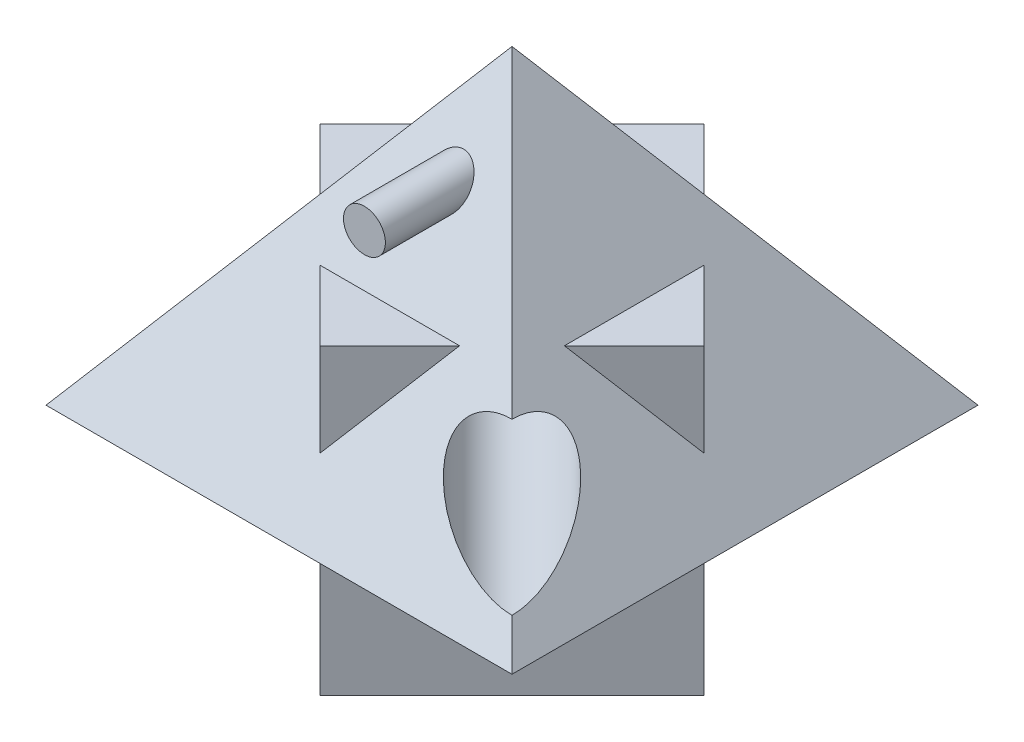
from build123d import *

# Parameters (mm, degrees)
BOSS_EXTRUDE1_DEPTH     = 99.06
CUT_EXTRUDE1_DEPTH      = 184.006502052
CUT_EXTRUDE1_DEPTH_BACK = 184.006502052
SKETCH4_R               = 15.875
SKETCH5_R               = 6.852684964
BOSS_EXTRUDE2_DEPTH     = 48.26


with BuildPart() as part:
    # Sketch1 → Loft1 section 0
    with BuildSketch(Plane(origin=(0, 0, 0), x_dir=(1, 0, 0), z_dir=(0, 1, 0)), mode=Mode.PRIVATE) as loft1_s0:
        with BuildLine():
            Line((-76.2, -76.2), (76.2, -76.2))
            Line((76.2, -76.2), (76.2, 76.2))
            Line((76.2, 76.2), (-76.2, 76.2))
            Line((-76.2, 76.2), (-76.2, -76.2))
        make_face()
    loft([loft1_s0.sketch, Vertex(0, 101.6, 0)])

    # Sketch3 → Boss-Extrude1 (add)
    with BuildSketch(Plane.XZ.offset(50.8)):
        Polygon((0, -62.861792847), (62.861792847, 0), (0, 62.861792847), (-62.861792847, 0), align=None)
    extrude(amount=-BOSS_EXTRUDE1_DEPTH)

    # Sketch4 → Cut-Extrude1 (cut, two sides: drawn at the far end of the back side and taken through both)
    with BuildSketch(Plane(origin=(31.430896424, 0, 31.430896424), x_dir=(0.7071067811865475, 0, -0.7071067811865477), z_dir=(0.7071067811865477, 0, 0.7071067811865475)).offset(-CUT_EXTRUDE1_DEPTH_BACK)):
        with Locations(Location((0, 25.4, 0), (0, 0, 270))):
            Circle(SKETCH4_R)
    extrude(amount=CUT_EXTRUDE1_DEPTH + CUT_EXTRUDE1_DEPTH_BACK, mode=Mode.SUBTRACT)

    # Sketch5 → Boss-Extrude2 (add)
    with BuildSketch(Plane.XY):
        with Locations(Location((0, 73.617399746, 0), (0, 0, 90))):
            Circle(SKETCH5_R)
    extrude(amount=BOSS_EXTRUDE2_DEPTH)


solid = part.part
